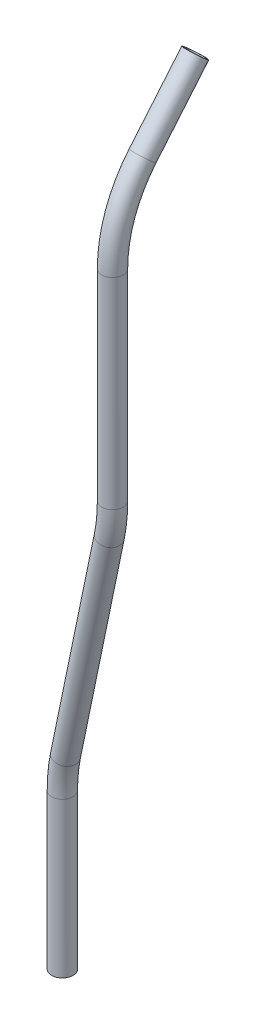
ISO-10303-21;
HEADER;
FILE_DESCRIPTION(('STEP AP214'),'2;1');
FILE_NAME('part.step','',(''),(''),'','','');
FILE_SCHEMA(('AUTOMOTIVE_DESIGN { 1 0 10303 214 1 1 1 1 }'));
ENDSEC;
DATA;
#1=APPLICATION_CONTEXT('core data for automotive mechanical design processes');
#2=APPLICATION_PROTOCOL_DEFINITION('international standard','automotive_design',2000,#1);
#3=PRODUCT_CONTEXT('',#1,'mechanical');
#4=PRODUCT('Part','Part','',(#3));
#5=PRODUCT_RELATED_PRODUCT_CATEGORY('part','',(#4));
#6=PRODUCT_DEFINITION_FORMATION('','',#4);
#7=PRODUCT_DEFINITION_CONTEXT('part definition',#1,'design');
#8=PRODUCT_DEFINITION('design','',#6,#7);
#9=PRODUCT_DEFINITION_SHAPE('','',#8);
#10=(LENGTH_UNIT() NAMED_UNIT(*) SI_UNIT(.MILLI.,.METRE.));
#11=(NAMED_UNIT(*) PLANE_ANGLE_UNIT() SI_UNIT($,.RADIAN.));
#12=(NAMED_UNIT(*) SI_UNIT($,.STERADIAN.) SOLID_ANGLE_UNIT());
#13=UNCERTAINTY_MEASURE_WITH_UNIT(LENGTH_MEASURE(1.E-05),#10,'distance_accuracy_value','');
#14=(GEOMETRIC_REPRESENTATION_CONTEXT(3) GLOBAL_UNCERTAINTY_ASSIGNED_CONTEXT((#13)) GLOBAL_UNIT_ASSIGNED_CONTEXT((#10,
#11,#12)) REPRESENTATION_CONTEXT('',''));
#15=CARTESIAN_POINT('',(0.,0.,0.));
#16=DIRECTION('',(0.,0.,1.));
#17=DIRECTION('',(1.,0.,0.));
#18=AXIS2_PLACEMENT_3D('',#15,#16,#17);
#19=CARTESIAN_POINT('',(0.,45.7840398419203,0.));
#20=DIRECTION('',(0.,-1.,0.));
#21=DIRECTION('',(0.,0.,-1.));
#22=AXIS2_PLACEMENT_3D('',#19,#20,#21);
#23=CYLINDRICAL_SURFACE('',#22,2.667);
#24=CARTESIAN_POINT('',(0.,0.,0.));
#25=DIRECTION('',(0.,1.,0.));
#26=DIRECTION('',(0.,0.,1.));
#27=AXIS2_PLACEMENT_3D('',#24,#25,#26);
#28=CIRCLE('',#27,2.667);
#29=CARTESIAN_POINT('',(0.,0.,2.667));
#30=VERTEX_POINT('',#29);
#31=EDGE_CURVE('E43',#30,#30,#28,.T.);
#32=ORIENTED_EDGE('',*,*,#31,.F.);
#33=EDGE_LOOP('',(#32));
#34=FACE_BOUND('',#33,.T.);
#35=CARTESIAN_POINT('',(0.,45.7840398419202,0.));
#36=DIRECTION('',(0.,-1.,0.));
#37=DIRECTION('',(0.,0.,-1.));
#38=AXIS2_PLACEMENT_3D('',#35,#36,#37);
#39=CIRCLE('',#38,2.667);
#40=CARTESIAN_POINT('',(-2.58434471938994,45.7840398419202,-0.658825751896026));
#41=VERTEX_POINT('',#40);
#42=EDGE_CURVE('E54',#41,#41,#39,.T.);
#43=ORIENTED_EDGE('',*,*,#42,.F.);
#44=EDGE_LOOP('',(#43));
#45=FACE_BOUND('',#44,.T.);
#46=ADVANCED_FACE('F36',(#34,#45),#23,.F.);
#47=CARTESIAN_POINT('',(0.,45.7840398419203,0.));
#48=DIRECTION('',(0.,-1.,0.));
#49=DIRECTION('',(0.,0.,-1.));
#50=AXIS2_PLACEMENT_3D('',#47,#48,#49);
#51=CYLINDRICAL_SURFACE('',#50,3.175);
#52=CARTESIAN_POINT('',(0.,0.,0.));
#53=DIRECTION('',(0.,1.,0.));
#54=DIRECTION('',(0.,0.,1.));
#55=AXIS2_PLACEMENT_3D('',#52,#53,#54);
#56=CIRCLE('',#55,3.175);
#57=CARTESIAN_POINT('',(0.,0.,3.175));
#58=VERTEX_POINT('',#57);
#59=EDGE_CURVE('E47',#58,#58,#56,.T.);
#60=ORIENTED_EDGE('',*,*,#59,.T.);
#61=EDGE_LOOP('',(#60));
#62=FACE_BOUND('',#61,.T.);
#63=CARTESIAN_POINT('',(0.,45.7840398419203,0.));
#64=DIRECTION('',(0.,1.,0.));
#65=DIRECTION('',(0.,0.,1.));
#66=AXIS2_PLACEMENT_3D('',#63,#64,#65);
#67=CIRCLE('',#66,3.175);
#68=CARTESIAN_POINT('',(-3.0766008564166,45.7840398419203,-0.784316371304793));
#69=VERTEX_POINT('',#68);
#70=EDGE_CURVE('E11',#69,#69,#67,.T.);
#71=ORIENTED_EDGE('',*,*,#70,.F.);
#72=EDGE_LOOP('',(#71));
#73=FACE_BOUND('',#72,.T.);
#74=ADVANCED_FACE('F38',(#62,#73),#51,.T.);
#75=CARTESIAN_POINT('',(0.,0.,0.));
#76=DIRECTION('',(0.,1.,0.));
#77=DIRECTION('',(0.,0.,1.));
#78=AXIS2_PLACEMENT_3D('',#75,#76,#77);
#79=PLANE('',#78);
#80=ORIENTED_EDGE('',*,*,#31,.T.);
#81=EDGE_LOOP('',(#80));
#82=FACE_BOUND('',#81,.T.);
#83=ORIENTED_EDGE('',*,*,#59,.F.);
#84=EDGE_LOOP('',(#83));
#85=FACE_BOUND('',#84,.T.);
#86=ADVANCED_FACE('F140',(#82,#85),#79,.F.);
#87=CARTESIAN_POINT('',(36.9192102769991,45.7840398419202,9.41179645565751));
#88=DIRECTION('',(-0.247028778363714,0.,0.969008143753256));
#89=DIRECTION('',(0.969008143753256,0.,0.247028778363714));
#90=AXIS2_PLACEMENT_3D('',#87,#88,#89);
#91=TOROIDAL_SURFACE('',#90,38.1,2.667);
#92=CARTESIAN_POINT('',(1.25799158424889,55.6450454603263,0.320699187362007));
#93=DIRECTION('',(-0.250797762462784,-0.965925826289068,-0.0639357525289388));
#94=DIRECTION('',(0.967906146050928,-0.2513119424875,0.));
#95=AXIS2_PLACEMENT_3D('',#92,#93,#94);
#96=CIRCLE('',#95,2.667);
#97=CARTESIAN_POINT('',(-1.23829372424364,56.3353158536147,-0.315677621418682));
#98=VERTEX_POINT('',#97);
#99=EDGE_CURVE('E60',#98,#98,#96,.T.);
#100=CARTESIAN_POINT('',(36.9192102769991,45.7840398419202,9.41179645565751));
#101=DIRECTION('',(-0.247028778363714,0.,0.969008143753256));
#102=DIRECTION('',(0.969008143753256,0.,0.247028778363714));
#103=AXIS2_PLACEMENT_3D('',#100,#101,#102);
#104=CIRCLE('',#103,40.767);
#105=EDGE_CURVE('',#98,#41,#104,.T.);
#106=ORIENTED_EDGE('',*,*,#99,.F.);
#107=ORIENTED_EDGE('',*,*,#42,.T.);
#108=ORIENTED_EDGE('',*,*,#105,.T.);
#109=ORIENTED_EDGE('',*,*,#105,.F.);
#110=EDGE_LOOP('',(#106,#108,#107,#109));
#111=FACE_BOUND('',#110,.T.);
#112=ADVANCED_FACE('F132',(#111),#91,.F.);
#113=CARTESIAN_POINT('',(36.9192102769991,45.7840398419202,9.41179645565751));
#114=DIRECTION('',(-0.247028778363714,0.,0.969008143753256));
#115=DIRECTION('',(0.969008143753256,0.,0.247028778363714));
#116=AXIS2_PLACEMENT_3D('',#113,#114,#115);
#117=TOROIDAL_SURFACE('',#116,38.1,3.175);
#118=CARTESIAN_POINT('',(1.25799158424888,55.6450454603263,0.320699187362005));
#119=DIRECTION('',(0.250797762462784,0.965925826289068,0.0639357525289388));
#120=DIRECTION('',(-0.967906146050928,0.2513119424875,0.));
#121=AXIS2_PLACEMENT_3D('',#118,#119,#120);
#122=CIRCLE('',#121,3.175);
#123=CARTESIAN_POINT('',(-1.71377664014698,56.4667959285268,-0.436892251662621));
#124=VERTEX_POINT('',#123);
#125=EDGE_CURVE('E51',#124,#124,#122,.T.);
#126=CARTESIAN_POINT('',(36.9192102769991,45.7840398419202,9.41179645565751));
#127=DIRECTION('',(-0.247028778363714,0.,0.969008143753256));
#128=DIRECTION('',(0.969008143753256,0.,0.247028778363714));
#129=AXIS2_PLACEMENT_3D('',#126,#127,#128);
#130=CIRCLE('',#129,41.275);
#131=EDGE_CURVE('',#124,#69,#130,.T.);
#132=ORIENTED_EDGE('',*,*,#125,.F.);
#133=ORIENTED_EDGE('',*,*,#70,.T.);
#134=ORIENTED_EDGE('',*,*,#131,.T.);
#135=ORIENTED_EDGE('',*,*,#131,.F.);
#136=EDGE_LOOP('',(#132,#134,#133,#135));
#137=FACE_BOUND('',#136,.T.);
#138=ADVANCED_FACE('F130',(#137),#117,.T.);
#139=CARTESIAN_POINT('',(18.6505084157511,122.630815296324,4.75456510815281));
#140=DIRECTION('',(-0.250797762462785,-0.965925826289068,-0.0639357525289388));
#141=DIRECTION('',(0.967906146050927,-0.251311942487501,0.));
#142=AXIS2_PLACEMENT_3D('',#139,#140,#141);
#143=CYLINDRICAL_SURFACE('',#142,2.667);
#144=CARTESIAN_POINT('',(18.6505084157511,122.630815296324,4.75456510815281));
#145=DIRECTION('',(-0.250797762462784,-0.965925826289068,-0.0639357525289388));
#146=DIRECTION('',(0.967906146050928,-0.2513119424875,0.));
#147=AXIS2_PLACEMENT_3D('',#144,#145,#146);
#148=CIRCLE('',#147,2.667);
#149=CARTESIAN_POINT('',(21.1467937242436,121.940544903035,5.3909419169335));
#150=VERTEX_POINT('',#149);
#151=EDGE_CURVE('E66',#150,#150,#148,.T.);
#152=ORIENTED_EDGE('',*,*,#151,.F.);
#153=EDGE_LOOP('',(#152));
#154=FACE_BOUND('',#153,.T.);
#155=ORIENTED_EDGE('',*,*,#99,.T.);
#156=EDGE_LOOP('',(#155));
#157=FACE_BOUND('',#156,.T.);
#158=ADVANCED_FACE('F126',(#154,#157),#143,.F.);
#159=CARTESIAN_POINT('',(18.6505084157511,122.630815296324,4.75456510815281));
#160=DIRECTION('',(-0.250797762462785,-0.965925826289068,-0.0639357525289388));
#161=DIRECTION('',(0.967906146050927,-0.251311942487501,0.));
#162=AXIS2_PLACEMENT_3D('',#159,#160,#161);
#163=CYLINDRICAL_SURFACE('',#162,3.175);
#164=CARTESIAN_POINT('',(18.6505084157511,122.630815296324,4.75456510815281));
#165=DIRECTION('',(0.250797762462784,0.965925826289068,0.0639357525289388));
#166=DIRECTION('',(-0.967906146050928,0.2513119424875,0.));
#167=AXIS2_PLACEMENT_3D('',#164,#165,#166);
#168=CIRCLE('',#167,3.175);
#169=CARTESIAN_POINT('',(21.622276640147,121.809064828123,5.51215654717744));
#170=VERTEX_POINT('',#169);
#171=EDGE_CURVE('E57',#170,#170,#168,.T.);
#172=ORIENTED_EDGE('',*,*,#171,.F.);
#173=EDGE_LOOP('',(#172));
#174=FACE_BOUND('',#173,.T.);
#175=ORIENTED_EDGE('',*,*,#125,.T.);
#176=EDGE_LOOP('',(#175));
#177=FACE_BOUND('',#176,.T.);
#178=ADVANCED_FACE('F123',(#174,#177),#163,.T.);
#179=CARTESIAN_POINT('',(-17.0107102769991,132.49182091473,-4.33653216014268));
#180=DIRECTION('',(0.247028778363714,0.,-0.969008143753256));
#181=DIRECTION('',(-0.969008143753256,0.,-0.247028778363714));
#182=AXIS2_PLACEMENT_3D('',#179,#180,#181);
#183=TOROIDAL_SURFACE('',#182,38.1,2.667);
#184=CARTESIAN_POINT('',(19.9085,132.49182091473,5.07526429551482));
#185=DIRECTION('',(0.,-1.,0.));
#186=DIRECTION('',(0.,0.,-1.));
#187=AXIS2_PLACEMENT_3D('',#184,#185,#186);
#188=CIRCLE('',#187,2.667);
#189=CARTESIAN_POINT('',(22.4928447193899,132.49182091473,5.73409004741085));
#190=VERTEX_POINT('',#189);
#191=EDGE_CURVE('E72',#190,#190,#188,.T.);
#192=CARTESIAN_POINT('',(-17.0107102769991,132.49182091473,-4.33653216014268));
#193=DIRECTION('',(0.247028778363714,0.,-0.969008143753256));
#194=DIRECTION('',(-0.969008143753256,0.,-0.247028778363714));
#195=AXIS2_PLACEMENT_3D('',#192,#193,#194);
#196=CIRCLE('',#195,40.767);
#197=EDGE_CURVE('',#190,#150,#196,.T.);
#198=ORIENTED_EDGE('',*,*,#191,.F.);
#199=ORIENTED_EDGE('',*,*,#151,.T.);
#200=ORIENTED_EDGE('',*,*,#197,.T.);
#201=ORIENTED_EDGE('',*,*,#197,.F.);
#202=EDGE_LOOP('',(#198,#200,#199,#201));
#203=FACE_BOUND('',#202,.T.);
#204=ADVANCED_FACE('F119',(#203),#183,.F.);
#205=CARTESIAN_POINT('',(-17.0107102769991,132.49182091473,-4.33653216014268));
#206=DIRECTION('',(0.247028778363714,0.,-0.969008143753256));
#207=DIRECTION('',(-0.969008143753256,0.,-0.247028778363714));
#208=AXIS2_PLACEMENT_3D('',#205,#206,#207);
#209=TOROIDAL_SURFACE('',#208,38.1,3.175);
#210=CARTESIAN_POINT('',(19.9085,132.49182091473,5.07526429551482));
#211=DIRECTION('',(0.,1.,0.));
#212=DIRECTION('',(-1.,0.,0.));
#213=AXIS2_PLACEMENT_3D('',#210,#211,#212);
#214=CIRCLE('',#213,3.175);
#215=CARTESIAN_POINT('',(22.9851008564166,132.49182091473,5.85958066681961));
#216=VERTEX_POINT('',#215);
#217=EDGE_CURVE('E63',#216,#216,#214,.T.);
#218=CARTESIAN_POINT('',(-17.0107102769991,132.49182091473,-4.33653216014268));
#219=DIRECTION('',(0.247028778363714,0.,-0.969008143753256));
#220=DIRECTION('',(-0.969008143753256,0.,-0.247028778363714));
#221=AXIS2_PLACEMENT_3D('',#218,#219,#220);
#222=CIRCLE('',#221,41.275);
#223=EDGE_CURVE('',#216,#170,#222,.T.);
#224=ORIENTED_EDGE('',*,*,#217,.F.);
#225=ORIENTED_EDGE('',*,*,#171,.T.);
#226=ORIENTED_EDGE('',*,*,#223,.T.);
#227=ORIENTED_EDGE('',*,*,#223,.F.);
#228=EDGE_LOOP('',(#224,#226,#225,#227));
#229=FACE_BOUND('',#228,.T.);
#230=ADVANCED_FACE('F116',(#229),#209,.T.);
#231=CARTESIAN_POINT('',(19.9085,191.994944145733,5.07526429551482));
#232=DIRECTION('',(0.,-1.,0.));
#233=DIRECTION('',(0.,0.,-1.));
#234=AXIS2_PLACEMENT_3D('',#231,#232,#233);
#235=CYLINDRICAL_SURFACE('',#234,2.667);
#236=CARTESIAN_POINT('',(19.9085,191.994944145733,5.0752642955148));
#237=DIRECTION('',(0.,-1.,0.));
#238=DIRECTION('',(0.,0.,-1.));
#239=AXIS2_PLACEMENT_3D('',#236,#237,#238);
#240=CIRCLE('',#239,2.667);
#241=CARTESIAN_POINT('',(19.9085,191.994944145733,7.74226429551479));
#242=VERTEX_POINT('',#241);
#243=EDGE_CURVE('E78',#242,#242,#240,.T.);
#244=ORIENTED_EDGE('',*,*,#243,.F.);
#245=EDGE_LOOP('',(#244));
#246=FACE_BOUND('',#245,.T.);
#247=ORIENTED_EDGE('',*,*,#191,.T.);
#248=EDGE_LOOP('',(#247));
#249=FACE_BOUND('',#248,.T.);
#250=ADVANCED_FACE('F112',(#246,#249),#235,.F.);
#251=CARTESIAN_POINT('',(19.9085,191.994944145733,5.07526429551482));
#252=DIRECTION('',(0.,-1.,0.));
#253=DIRECTION('',(0.,0.,-1.));
#254=AXIS2_PLACEMENT_3D('',#251,#252,#253);
#255=CYLINDRICAL_SURFACE('',#254,3.175);
#256=CARTESIAN_POINT('',(19.9085,191.994944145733,5.07526429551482));
#257=DIRECTION('',(0.,1.,0.));
#258=DIRECTION('',(0.,0.,1.));
#259=AXIS2_PLACEMENT_3D('',#256,#257,#258);
#260=CIRCLE('',#259,3.175);
#261=CARTESIAN_POINT('',(19.9085,191.994944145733,8.2502642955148));
#262=VERTEX_POINT('',#261);
#263=EDGE_CURVE('E69',#262,#262,#260,.T.);
#264=ORIENTED_EDGE('',*,*,#263,.F.);
#265=EDGE_LOOP('',(#264));
#266=FACE_BOUND('',#265,.T.);
#267=ORIENTED_EDGE('',*,*,#217,.T.);
#268=EDGE_LOOP('',(#267));
#269=FACE_BOUND('',#268,.T.);
#270=ADVANCED_FACE('F109',(#266,#269),#255,.T.);
#271=CARTESIAN_POINT('',(19.9085,191.994944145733,-33.0247357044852));
#272=DIRECTION('',(1.,0.,0.));
#273=DIRECTION('',(0.,0.,-1.));
#274=AXIS2_PLACEMENT_3D('',#271,#272,#273);
#275=TOROIDAL_SURFACE('',#274,38.1,2.667);
#276=CARTESIAN_POINT('',(19.9085,216.485152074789,-3.83844242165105));
#277=DIRECTION('',(0.,-0.766044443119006,0.642787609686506));
#278=DIRECTION('',(0.,-0.642787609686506,-0.766044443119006));
#279=AXIS2_PLACEMENT_3D('',#276,#277,#278);
#280=CIRCLE('',#279,2.667);
#281=CARTESIAN_POINT('',(19.9085,218.199466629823,-1.79540189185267));
#282=VERTEX_POINT('',#281);
#283=EDGE_CURVE('E84',#282,#282,#280,.T.);
#284=CARTESIAN_POINT('',(19.9085,191.994944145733,-33.0247357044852));
#285=DIRECTION('',(1.,0.,0.));
#286=DIRECTION('',(0.,0.,-1.));
#287=AXIS2_PLACEMENT_3D('',#284,#285,#286);
#288=CIRCLE('',#287,40.767);
#289=EDGE_CURVE('',#282,#242,#288,.T.);
#290=ORIENTED_EDGE('',*,*,#283,.F.);
#291=ORIENTED_EDGE('',*,*,#243,.T.);
#292=ORIENTED_EDGE('',*,*,#289,.T.);
#293=ORIENTED_EDGE('',*,*,#289,.F.);
#294=EDGE_LOOP('',(#290,#292,#291,#293));
#295=FACE_BOUND('',#294,.T.);
#296=ADVANCED_FACE('F105',(#295),#275,.F.);
#297=CARTESIAN_POINT('',(19.9085,191.994944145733,-33.0247357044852));
#298=DIRECTION('',(1.,0.,0.));
#299=DIRECTION('',(0.,0.,-1.));
#300=AXIS2_PLACEMENT_3D('',#297,#298,#299);
#301=TOROIDAL_SURFACE('',#300,38.1,3.175);
#302=CARTESIAN_POINT('',(19.9085,216.485152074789,-3.83844242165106));
#303=DIRECTION('',(0.,0.766044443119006,-0.642787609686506));
#304=DIRECTION('',(0.,0.642787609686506,0.766044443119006));
#305=AXIS2_PLACEMENT_3D('',#302,#303,#304);
#306=CIRCLE('',#305,3.175);
#307=CARTESIAN_POINT('',(19.9085,218.526002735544,-1.4062513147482));
#308=VERTEX_POINT('',#307);
#309=EDGE_CURVE('E75',#308,#308,#306,.T.);
#310=CARTESIAN_POINT('',(19.9085,191.994944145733,-33.0247357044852));
#311=DIRECTION('',(1.,0.,0.));
#312=DIRECTION('',(0.,0.,-1.));
#313=AXIS2_PLACEMENT_3D('',#310,#311,#312);
#314=CIRCLE('',#313,41.275);
#315=EDGE_CURVE('',#308,#262,#314,.T.);
#316=ORIENTED_EDGE('',*,*,#309,.F.);
#317=ORIENTED_EDGE('',*,*,#263,.T.);
#318=ORIENTED_EDGE('',*,*,#315,.T.);
#319=ORIENTED_EDGE('',*,*,#315,.F.);
#320=EDGE_LOOP('',(#316,#318,#317,#319));
#321=FACE_BOUND('',#320,.T.);
#322=ADVANCED_FACE('F102',(#321),#301,.T.);
#323=CARTESIAN_POINT('',(19.9085,235.048503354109,-19.4149436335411));
#324=DIRECTION('',(0.,-0.766044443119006,0.642787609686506));
#325=DIRECTION('',(0.,-0.642787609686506,-0.766044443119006));
#326=AXIS2_PLACEMENT_3D('',#323,#324,#325);
#327=CYLINDRICAL_SURFACE('',#326,2.667);
#328=CARTESIAN_POINT('',(19.9085,235.048503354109,-19.4149436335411));
#329=DIRECTION('',(0.,0.766044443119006,-0.642787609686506));
#330=DIRECTION('',(0.,0.642787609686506,0.766044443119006));
#331=AXIS2_PLACEMENT_3D('',#328,#329,#330);
#332=CIRCLE('',#331,2.667);
#333=CARTESIAN_POINT('',(19.9085,236.762817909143,-17.3719031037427));
#334=VERTEX_POINT('',#333);
#335=EDGE_CURVE('E87',#334,#334,#332,.T.);
#336=ORIENTED_EDGE('',*,*,#335,.T.);
#337=EDGE_LOOP('',(#336));
#338=FACE_BOUND('',#337,.T.);
#339=ORIENTED_EDGE('',*,*,#283,.T.);
#340=EDGE_LOOP('',(#339));
#341=FACE_BOUND('',#340,.T.);
#342=ADVANCED_FACE('F98',(#338,#341),#327,.F.);
#343=CARTESIAN_POINT('',(19.9085,235.048503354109,-19.4149436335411));
#344=DIRECTION('',(0.,-0.766044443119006,0.642787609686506));
#345=DIRECTION('',(0.,-0.642787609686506,-0.766044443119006));
#346=AXIS2_PLACEMENT_3D('',#343,#344,#345);
#347=CYLINDRICAL_SURFACE('',#346,3.175);
#348=CARTESIAN_POINT('',(19.9085,235.048503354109,-19.4149436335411));
#349=DIRECTION('',(0.,0.766044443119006,-0.642787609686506));
#350=DIRECTION('',(0.,0.642787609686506,0.766044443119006));
#351=AXIS2_PLACEMENT_3D('',#348,#349,#350);
#352=CIRCLE('',#351,3.175);
#353=CARTESIAN_POINT('',(19.9085,237.089354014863,-16.9827525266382));
#354=VERTEX_POINT('',#353);
#355=EDGE_CURVE('E81',#354,#354,#352,.T.);
#356=ORIENTED_EDGE('',*,*,#355,.F.);
#357=EDGE_LOOP('',(#356));
#358=FACE_BOUND('',#357,.T.);
#359=ORIENTED_EDGE('',*,*,#309,.T.);
#360=EDGE_LOOP('',(#359));
#361=FACE_BOUND('',#360,.T.);
#362=ADVANCED_FACE('F95',(#358,#361),#347,.T.);
#363=CARTESIAN_POINT('',(19.9085,235.048503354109,-19.4149436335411));
#364=DIRECTION('',(0.,0.766044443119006,-0.642787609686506));
#365=DIRECTION('',(0.,0.642787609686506,0.766044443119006));
#366=AXIS2_PLACEMENT_3D('',#363,#364,#365);
#367=PLANE('',#366);
#368=ORIENTED_EDGE('',*,*,#335,.F.);
#369=EDGE_LOOP('',(#368));
#370=FACE_BOUND('',#369,.T.);
#371=ORIENTED_EDGE('',*,*,#355,.T.);
#372=EDGE_LOOP('',(#371));
#373=FACE_BOUND('',#372,.T.);
#374=ADVANCED_FACE('F93',(#370,#373),#367,.T.);
#375=CLOSED_SHELL('',(#46,#74,#86,#112,#138,#158,#178,#204,#230,#250,#270,#296,#322,#342,#362,#374));
#376=MANIFOLD_SOLID_BREP('B2',#375);
#377=ADVANCED_BREP_SHAPE_REPRESENTATION('',(#18,#376),#14);
#378=SHAPE_DEFINITION_REPRESENTATION(#9,#377);
ENDSEC;
END-ISO-10303-21;
